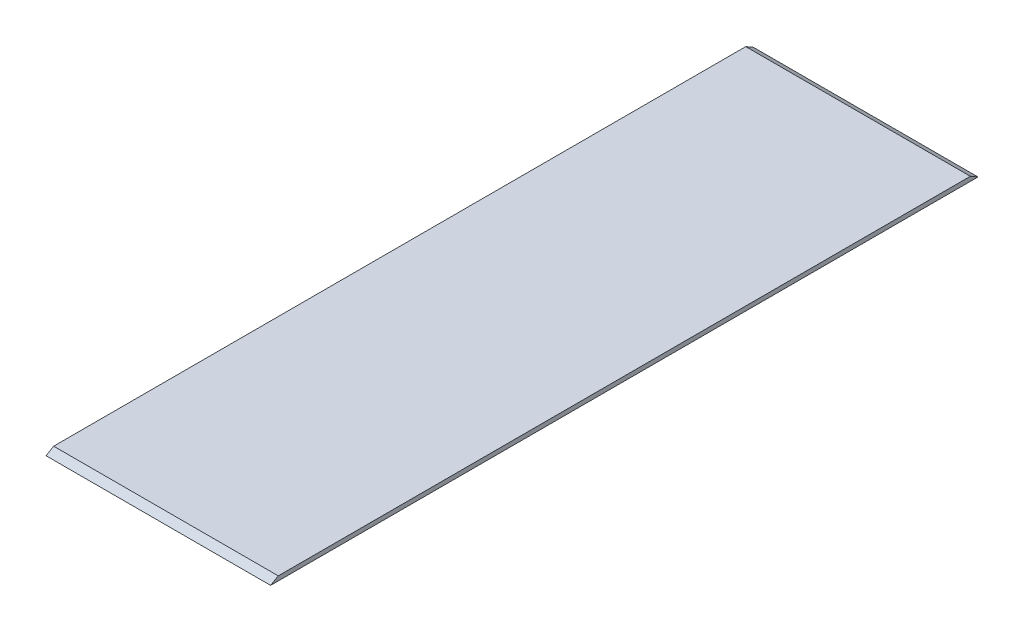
from build123d import *

# Parameters (mm, degrees)
SKETCH1_W      = 645.16
SKETCH1_H      = 2032
EXTRUDE1_DEPTH = 6.35
EXTRUDE2_DEPTH = 1204.547983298


with BuildPart() as part:
    # Sketch1 → Extrude1 (new, symmetric)
    with BuildSketch(Plane(origin=(0, 0, 0), x_dir=(1, 0, 0), z_dir=(0, 1, 0))):
        Rectangle(SKETCH1_W, SKETCH1_H)
    extrude(amount=EXTRUDE1_DEPTH, both=True)

    # Sketch2 → Extrude2 (cut, through all)
    with BuildSketch(Plane(origin=(322.58, 0, 0), x_dir=(0, 0, -1), z_dir=(1, 0, 0))):
        Polygon((-1016, 6.35), (-1016, -6.35), (-994.002954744, 6.35), align=None)
        Polygon((994.002954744, 6.35), (1016, -6.35), (1016, 6.35), align=None)
    extrude(amount=-EXTRUDE2_DEPTH, mode=Mode.SUBTRACT)


solid = part.part
